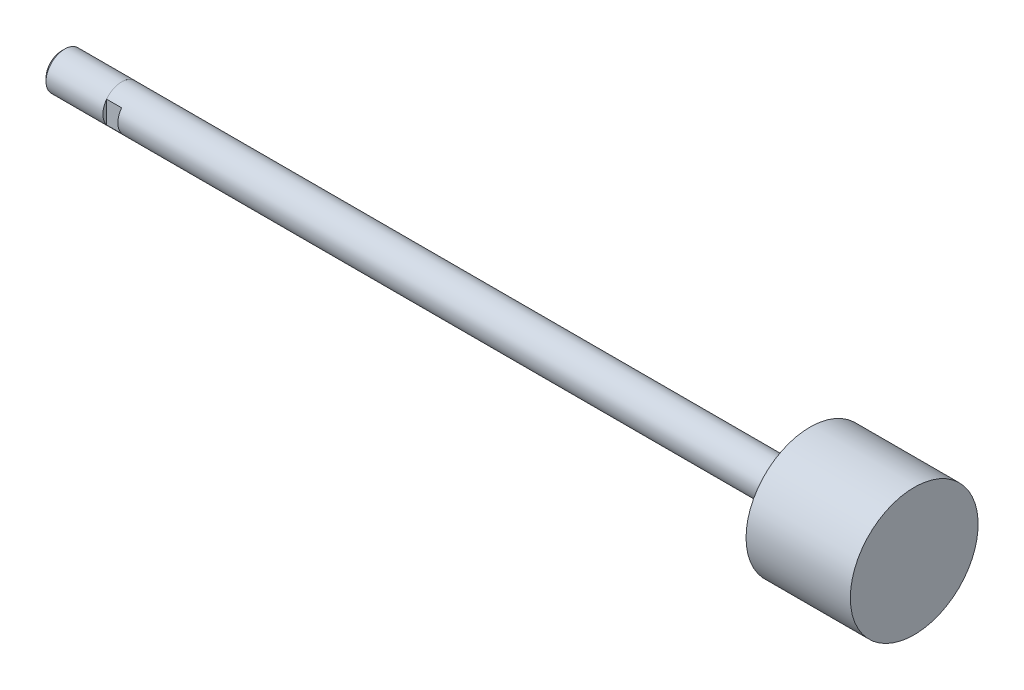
ISO-10303-21;
HEADER;
FILE_DESCRIPTION(('STEP AP214'),'2;1');
FILE_NAME('part.step','',(''),(''),'','','');
FILE_SCHEMA(('AUTOMOTIVE_DESIGN { 1 0 10303 214 1 1 1 1 }'));
ENDSEC;
DATA;
#1=APPLICATION_CONTEXT('core data for automotive mechanical design processes');
#2=APPLICATION_PROTOCOL_DEFINITION('international standard','automotive_design',2000,#1);
#3=PRODUCT_CONTEXT('',#1,'mechanical');
#4=PRODUCT('Part','Part','',(#3));
#5=PRODUCT_RELATED_PRODUCT_CATEGORY('part','',(#4));
#6=PRODUCT_DEFINITION_FORMATION('','',#4);
#7=PRODUCT_DEFINITION_CONTEXT('part definition',#1,'design');
#8=PRODUCT_DEFINITION('design','',#6,#7);
#9=PRODUCT_DEFINITION_SHAPE('','',#8);
#10=(LENGTH_UNIT() NAMED_UNIT(*) SI_UNIT(.MILLI.,.METRE.));
#11=(NAMED_UNIT(*) PLANE_ANGLE_UNIT() SI_UNIT($,.RADIAN.));
#12=(NAMED_UNIT(*) SI_UNIT($,.STERADIAN.) SOLID_ANGLE_UNIT());
#13=UNCERTAINTY_MEASURE_WITH_UNIT(LENGTH_MEASURE(1.E-05),#10,'distance_accuracy_value','');
#14=(GEOMETRIC_REPRESENTATION_CONTEXT(3) GLOBAL_UNCERTAINTY_ASSIGNED_CONTEXT((#13)) GLOBAL_UNIT_ASSIGNED_CONTEXT((#10,
#11,#12)) REPRESENTATION_CONTEXT('',''));
#15=CARTESIAN_POINT('',(0.,0.,0.));
#16=DIRECTION('',(0.,0.,1.));
#17=DIRECTION('',(1.,0.,0.));
#18=AXIS2_PLACEMENT_3D('',#15,#16,#17);
#19=CARTESIAN_POINT('',(-15.875,0.,0.));
#20=DIRECTION('',(1.,0.,0.));
#21=DIRECTION('',(0.,0.,-1.));
#22=AXIS2_PLACEMENT_3D('',#19,#20,#21);
#23=PLANE('',#22);
#24=CARTESIAN_POINT('',(-15.8749999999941,0.,0.));
#25=DIRECTION('',(1.,0.,0.));
#26=DIRECTION('',(0.,1.,0.));
#27=AXIS2_PLACEMENT_3D('',#24,#25,#26);
#28=CIRCLE('',#27,3.33883000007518);
#29=CARTESIAN_POINT('',(-15.8749999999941,3.33883000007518,0.));
#30=VERTEX_POINT('',#29);
#31=EDGE_CURVE('E20',#30,#30,#28,.T.);
#32=ORIENTED_EDGE('',*,*,#31,.F.);
#33=EDGE_LOOP('',(#32));
#34=FACE_BOUND('',#33,.T.);
#35=ADVANCED_FACE('F17',(#34),#23,.F.);
#36=CARTESIAN_POINT('',(164.9984,13.55725,0.));
#37=DIRECTION('',(-1.,0.,0.));
#38=DIRECTION('',(0.,0.,1.));
#39=AXIS2_PLACEMENT_3D('',#36,#37,#38);
#40=PLANE('',#39);
#41=CARTESIAN_POINT('',(164.9984,0.,0.));
#42=DIRECTION('',(-1.,0.,0.));
#43=DIRECTION('',(0.,0.,1.));
#44=AXIS2_PLACEMENT_3D('',#41,#42,#43);
#45=CIRCLE('',#44,13.55725);
#46=CARTESIAN_POINT('',(164.9984,0.,13.55725));
#47=VERTEX_POINT('',#46);
#48=EDGE_CURVE('E92',#47,#47,#45,.T.);
#49=ORIENTED_EDGE('',*,*,#48,.F.);
#50=EDGE_LOOP('',(#49));
#51=FACE_BOUND('',#50,.T.);
#52=ADVANCED_FACE('F105',(#51),#40,.F.);
#53=CARTESIAN_POINT('',(-15.2450799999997,0.,0.));
#54=DIRECTION('',(1.,0.,0.));
#55=DIRECTION('',(0.,1.,0.));
#56=AXIS2_PLACEMENT_3D('',#53,#54,#55);
#57=CONICAL_SURFACE('',#56,3.96875000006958,0.785398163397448);
#58=ORIENTED_EDGE('',*,*,#31,.T.);
#59=EDGE_LOOP('',(#58));
#60=FACE_BOUND('',#59,.T.);
#61=CARTESIAN_POINT('',(-15.24508,0.,0.));
#62=DIRECTION('',(-1.,0.,0.));
#63=DIRECTION('',(0.,0.,1.));
#64=AXIS2_PLACEMENT_3D('',#61,#62,#63);
#65=CIRCLE('',#64,3.96875);
#66=CARTESIAN_POINT('',(-15.24508,0.,3.96875));
#67=VERTEX_POINT('',#66);
#68=EDGE_CURVE('E91',#67,#67,#65,.F.);
#69=ORIENTED_EDGE('',*,*,#68,.F.);
#70=EDGE_LOOP('',(#69));
#71=FACE_BOUND('',#70,.T.);
#72=ADVANCED_FACE('F101',(#60,#71),#57,.T.);
#73=CARTESIAN_POINT('',(164.9984,0.,0.));
#74=DIRECTION('',(-1.,0.,0.));
#75=DIRECTION('',(0.,0.,1.));
#76=AXIS2_PLACEMENT_3D('',#73,#74,#75);
#77=CYLINDRICAL_SURFACE('',#76,13.55725);
#78=CARTESIAN_POINT('',(142.875,0.,0.));
#79=DIRECTION('',(-1.,0.,0.));
#80=DIRECTION('',(0.,0.,1.));
#81=AXIS2_PLACEMENT_3D('',#78,#79,#80);
#82=CIRCLE('',#81,13.55725);
#83=CARTESIAN_POINT('',(142.875,0.,13.55725));
#84=VERTEX_POINT('',#83);
#85=EDGE_CURVE('E89',#84,#84,#82,.F.);
#86=ORIENTED_EDGE('',*,*,#85,.T.);
#87=EDGE_LOOP('',(#86));
#88=FACE_BOUND('',#87,.T.);
#89=ORIENTED_EDGE('',*,*,#48,.T.);
#90=EDGE_LOOP('',(#89));
#91=FACE_BOUND('',#90,.T.);
#92=ADVANCED_FACE('F139',(#88,#91),#77,.T.);
#93=CARTESIAN_POINT('',(-3.175,0.,0.));
#94=DIRECTION('',(-1.,0.,0.));
#95=DIRECTION('',(0.,0.,1.));
#96=AXIS2_PLACEMENT_3D('',#93,#94,#95);
#97=CYLINDRICAL_SURFACE('',#96,3.96875);
#98=ORIENTED_EDGE('',*,*,#68,.T.);
#99=EDGE_LOOP('',(#98));
#100=FACE_BOUND('',#99,.T.);
#101=CARTESIAN_POINT('',(-3.175,0.,0.));
#102=DIRECTION('',(-1.,0.,0.));
#103=DIRECTION('',(0.,0.,1.));
#104=AXIS2_PLACEMENT_3D('',#101,#102,#103);
#105=CIRCLE('',#104,3.96875);
#106=CARTESIAN_POINT('',(-3.175,0.,3.96875));
#107=VERTEX_POINT('',#106);
#108=EDGE_CURVE('E65',#107,#107,#105,.T.);
#109=ORIENTED_EDGE('',*,*,#108,.T.);
#110=EDGE_LOOP('',(#109));
#111=FACE_BOUND('',#110,.T.);
#112=ADVANCED_FACE('F135',(#100,#111),#97,.T.);
#113=CARTESIAN_POINT('',(142.875,3.9624,0.));
#114=DIRECTION('',(1.,0.,0.));
#115=DIRECTION('',(0.,0.,-1.));
#116=AXIS2_PLACEMENT_3D('',#113,#114,#115);
#117=PLANE('',#116);
#118=CARTESIAN_POINT('',(142.875,0.,0.));
#119=DIRECTION('',(-1.,0.,0.));
#120=DIRECTION('',(0.,0.,1.));
#121=AXIS2_PLACEMENT_3D('',#118,#119,#120);
#122=CIRCLE('',#121,3.9624);
#123=CARTESIAN_POINT('',(142.875,0.,3.9624));
#124=VERTEX_POINT('',#123);
#125=EDGE_CURVE('E79',#124,#124,#122,.T.);
#126=ORIENTED_EDGE('',*,*,#125,.F.);
#127=EDGE_LOOP('',(#126));
#128=FACE_BOUND('',#127,.T.);
#129=ORIENTED_EDGE('',*,*,#85,.F.);
#130=EDGE_LOOP('',(#129));
#131=FACE_BOUND('',#130,.T.);
#132=ADVANCED_FACE('F131',(#128,#131),#117,.F.);
#133=CARTESIAN_POINT('',(0.,0.,0.));
#134=DIRECTION('',(1.,0.,0.));
#135=DIRECTION('',(0.,0.,-1.));
#136=AXIS2_PLACEMENT_3D('',#133,#134,#135);
#137=PLANE('',#136);
#138=CARTESIAN_POINT('',(0.,0.,0.));
#139=DIRECTION('',(-1.,0.,0.));
#140=DIRECTION('',(0.,0.,1.));
#141=AXIS2_PLACEMENT_3D('',#138,#139,#140);
#142=CIRCLE('',#141,3.9624);
#143=CARTESIAN_POINT('',(0.,2.37065154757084,3.175));
#144=VERTEX_POINT('',#143);
#145=CARTESIAN_POINT('',(0.,-2.37065154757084,3.175));
#146=VERTEX_POINT('',#145);
#147=EDGE_CURVE('E74',#144,#146,#142,.F.);
#148=ORIENTED_EDGE('',*,*,#147,.F.);
#149=DIRECTION('',(0.,1.,0.));
#150=VECTOR('',#149,1.);
#151=CARTESIAN_POINT('',(0.,3.9624,3.175));
#152=LINE('',#151,#150);
#153=EDGE_CURVE('E66',#144,#146,#152,.F.);
#154=ORIENTED_EDGE('',*,*,#153,.T.);
#155=EDGE_LOOP('',(#148,#154));
#156=FACE_BOUND('',#155,.T.);
#157=ADVANCED_FACE('F128',(#156),#137,.F.);
#158=CARTESIAN_POINT('',(0.,3.9624,3.175));
#159=DIRECTION('',(0.,0.,-1.));
#160=DIRECTION('',(-1.,0.,0.));
#161=AXIS2_PLACEMENT_3D('',#158,#159,#160);
#162=PLANE('',#161);
#163=DIRECTION('',(-1.,0.,0.));
#164=VECTOR('',#163,1.);
#165=CARTESIAN_POINT('',(164.9984,-2.37065154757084,3.175));
#166=LINE('',#165,#164);
#167=CARTESIAN_POINT('',(-3.17500000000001,-2.37065154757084,3.175));
#168=VERTEX_POINT('',#167);
#169=EDGE_CURVE('E252',#146,#168,#166,.T.);
#170=ORIENTED_EDGE('',*,*,#169,.F.);
#171=ORIENTED_EDGE('',*,*,#153,.F.);
#172=DIRECTION('',(-1.,0.,0.));
#173=VECTOR('',#172,1.);
#174=CARTESIAN_POINT('',(164.9984,2.37065154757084,3.175));
#175=LINE('',#174,#173);
#176=CARTESIAN_POINT('',(-3.17500000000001,2.37065154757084,3.175));
#177=VERTEX_POINT('',#176);
#178=EDGE_CURVE('E69',#177,#144,#175,.F.);
#179=ORIENTED_EDGE('',*,*,#178,.F.);
#180=DIRECTION('',(0.,1.,0.));
#181=VECTOR('',#180,1.);
#182=CARTESIAN_POINT('',(-3.175,3.96875,3.175));
#183=LINE('',#182,#181);
#184=EDGE_CURVE('E57',#177,#168,#183,.F.);
#185=ORIENTED_EDGE('',*,*,#184,.T.);
#186=EDGE_LOOP('',(#170,#171,#179,#185));
#187=FACE_BOUND('',#186,.T.);
#188=ADVANCED_FACE('F70',(#187),#162,.F.);
#189=CARTESIAN_POINT('',(-3.175,3.96875,0.));
#190=DIRECTION('',(-1.,0.,0.));
#191=DIRECTION('',(0.,0.,1.));
#192=AXIS2_PLACEMENT_3D('',#189,#190,#191);
#193=PLANE('',#192);
#194=ORIENTED_EDGE('',*,*,#108,.F.);
#195=EDGE_LOOP('',(#194));
#196=FACE_BOUND('',#195,.T.);
#197=DIRECTION('',(0.,1.,0.));
#198=VECTOR('',#197,1.);
#199=CARTESIAN_POINT('',(-3.175,-3.9624,-3.175));
#200=LINE('',#199,#198);
#201=CARTESIAN_POINT('',(-3.17500000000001,2.37065154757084,-3.175));
#202=VERTEX_POINT('',#201);
#203=CARTESIAN_POINT('',(-3.17500000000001,-2.37065154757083,-3.175));
#204=VERTEX_POINT('',#203);
#205=EDGE_CURVE('E82',#202,#204,#200,.F.);
#206=ORIENTED_EDGE('',*,*,#205,.T.);
#207=CARTESIAN_POINT('',(-3.17500000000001,0.,0.));
#208=DIRECTION('',(-1.,0.,0.));
#209=DIRECTION('',(0.,0.,1.));
#210=AXIS2_PLACEMENT_3D('',#207,#208,#209);
#211=CIRCLE('',#210,3.9624);
#212=EDGE_CURVE('E61',#168,#204,#211,.F.);
#213=ORIENTED_EDGE('',*,*,#212,.F.);
#214=ORIENTED_EDGE('',*,*,#184,.F.);
#215=CARTESIAN_POINT('',(-3.17500000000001,0.,0.));
#216=DIRECTION('',(-1.,0.,0.));
#217=DIRECTION('',(0.,0.,1.));
#218=AXIS2_PLACEMENT_3D('',#215,#216,#217);
#219=CIRCLE('',#218,3.9624);
#220=EDGE_CURVE('E54',#202,#177,#219,.F.);
#221=ORIENTED_EDGE('',*,*,#220,.F.);
#222=EDGE_LOOP('',(#206,#213,#214,#221));
#223=FACE_BOUND('',#222,.T.);
#224=ADVANCED_FACE('F59',(#196,#223),#193,.F.);
#225=CARTESIAN_POINT('',(0.,0.,0.));
#226=DIRECTION('',(1.,0.,0.));
#227=DIRECTION('',(0.,0.,-1.));
#228=AXIS2_PLACEMENT_3D('',#225,#226,#227);
#229=PLANE('',#228);
#230=CARTESIAN_POINT('',(0.,0.,0.));
#231=DIRECTION('',(-1.,0.,0.));
#232=DIRECTION('',(0.,0.,1.));
#233=AXIS2_PLACEMENT_3D('',#230,#231,#232);
#234=CIRCLE('',#233,3.9624);
#235=CARTESIAN_POINT('',(0.,-2.37065154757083,-3.175));
#236=VERTEX_POINT('',#235);
#237=CARTESIAN_POINT('',(0.,2.37065154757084,-3.175));
#238=VERTEX_POINT('',#237);
#239=EDGE_CURVE('E26',#236,#238,#234,.F.);
#240=ORIENTED_EDGE('',*,*,#239,.F.);
#241=DIRECTION('',(0.,1.,0.));
#242=VECTOR('',#241,1.);
#243=CARTESIAN_POINT('',(0.,-3.9624,-3.175));
#244=LINE('',#243,#242);
#245=EDGE_CURVE('E34',#236,#238,#244,.T.);
#246=ORIENTED_EDGE('',*,*,#245,.T.);
#247=EDGE_LOOP('',(#240,#246));
#248=FACE_BOUND('',#247,.T.);
#249=ADVANCED_FACE('F117',(#248),#229,.F.);
#250=CARTESIAN_POINT('',(0.,-3.9624,-3.175));
#251=DIRECTION('',(0.,0.,1.));
#252=DIRECTION('',(1.,0.,0.));
#253=AXIS2_PLACEMENT_3D('',#250,#251,#252);
#254=PLANE('',#253);
#255=DIRECTION('',(-1.,0.,0.));
#256=VECTOR('',#255,1.);
#257=CARTESIAN_POINT('',(164.9984,2.37065154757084,-3.175));
#258=LINE('',#257,#256);
#259=EDGE_CURVE('E11',#238,#202,#258,.T.);
#260=ORIENTED_EDGE('',*,*,#259,.F.);
#261=ORIENTED_EDGE('',*,*,#245,.F.);
#262=DIRECTION('',(-1.,0.,0.));
#263=VECTOR('',#262,1.);
#264=CARTESIAN_POINT('',(164.9984,-2.37065154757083,-3.175));
#265=LINE('',#264,#263);
#266=EDGE_CURVE('E254',#204,#236,#265,.F.);
#267=ORIENTED_EDGE('',*,*,#266,.F.);
#268=ORIENTED_EDGE('',*,*,#205,.F.);
#269=EDGE_LOOP('',(#260,#261,#267,#268));
#270=FACE_BOUND('',#269,.T.);
#271=ADVANCED_FACE('F112',(#270),#254,.F.);
#272=CARTESIAN_POINT('',(164.9984,0.,0.));
#273=DIRECTION('',(-1.,0.,0.));
#274=DIRECTION('',(0.,0.,1.));
#275=AXIS2_PLACEMENT_3D('',#272,#273,#274);
#276=CYLINDRICAL_SURFACE('',#275,3.9624);
#277=ORIENTED_EDGE('',*,*,#239,.T.);
#278=ORIENTED_EDGE('',*,*,#259,.T.);
#279=ORIENTED_EDGE('',*,*,#220,.T.);
#280=ORIENTED_EDGE('',*,*,#178,.T.);
#281=ORIENTED_EDGE('',*,*,#147,.T.);
#282=ORIENTED_EDGE('',*,*,#169,.T.);
#283=ORIENTED_EDGE('',*,*,#212,.T.);
#284=ORIENTED_EDGE('',*,*,#266,.T.);
#285=EDGE_LOOP('',(#277,#278,#279,#280,#281,#282,#283,#284));
#286=FACE_BOUND('',#285,.T.);
#287=ORIENTED_EDGE('',*,*,#125,.T.);
#288=EDGE_LOOP('',(#287));
#289=FACE_BOUND('',#288,.T.);
#290=ADVANCED_FACE('F77',(#286,#289),#276,.T.);
#291=CLOSED_SHELL('',(#35,#52,#72,#92,#112,#132,#157,#188,#224,#249,#271,#290));
#292=MANIFOLD_SOLID_BREP('B1',#291);
#293=ADVANCED_BREP_SHAPE_REPRESENTATION('',(#18,#292),#14);
#294=SHAPE_DEFINITION_REPRESENTATION(#9,#293);
ENDSEC;
END-ISO-10303-21;
